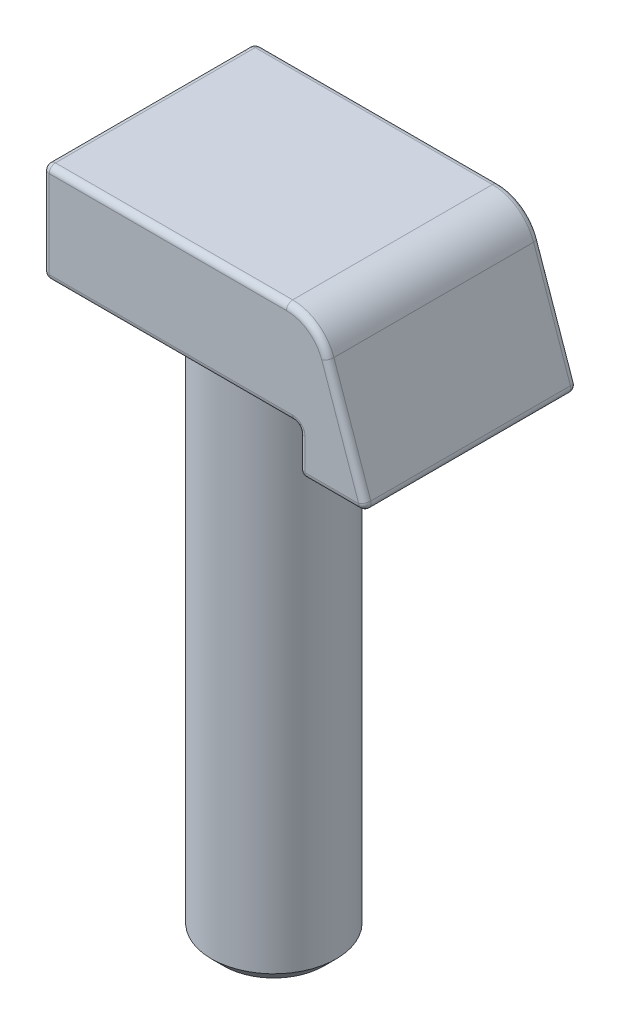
from build123d import *

# Parameters (mm, degrees)
EXTRUSION1_DEPTH = 17
CONG_1_R         = 0.5
ESQUISSE2_R      = 5
EXTRUSION2_DEPTH = 45
CHANFREIN1_SIZE  = 1


with BuildPart() as part:
    # Esquisse1 → Extrusion1 (new body)
    with BuildSketch(Plane.XY):
        with BuildLine():
            Line((0.5, 0), (20, 0))
            ThreePointArc((20, 0), (20.353553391, -0.146446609), (20.5, -0.5))
            Line((20.5, -0.5), (20.5, -3))
            ThreePointArc((20.5, -3), (20.646446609, -3.353553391), (21, -3.5))
            Line((21, -3.5), (25.296704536, -3.5))
            ThreePointArc((25.296704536, -3.5), (25.704215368, -3.289715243), (25.768952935, -2.835739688))
            Line((25.768952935, -2.835739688), (22.817453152, 5.649822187))
            ThreePointArc((22.817453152, 5.649822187), (21.539721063, 7.352575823), (19.511714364, 8))
            Line((19.511714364, 8), (0.5, 8))
            ThreePointArc((0.5, 8), (0.146446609, 7.853553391), (0, 7.5))
            Line((0, 7.5), (0, 0.5))
            ThreePointArc((0, 0.5), (0.146446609, 0.146446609), (0.5, 0))
        make_face()
    extrude(amount=EXTRUSION1_DEPTH)

    # Cong_1
    cong_1_edges = [part.edges().sort_by_distance(p)[0] for p in [
        (10.005857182, 8, 0),
        (10.005857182, 8, 17),
        (0.146446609, 7.853553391, 0),
        (0.146446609, 7.853553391, 17),
        (0, 4, 0),
        (0, 4, 17),
        (0.146446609, 0.146446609, 0),
        (0.146446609, 0.146446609, 17),
        (10.25, 0, 0),
        (10.25, 0, 17),
        (20.353553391, -0.146446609, 0),
        (20.353553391, -0.146446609, 17),
        (20.5, -1.75, 0),
        (20.5, -1.75, 17),
        (20.646446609, -3.353553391, 0),
        (20.646446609, -3.353553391, 17),
        (23.148352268, -3.5, 0),
        (23.148352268, -3.5, 17),
        (25.704215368, -3.289715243, 0),
        (25.704215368, -3.289715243, 17),
        (24.293203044, 1.40704125, 0),
        (24.293203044, 1.40704125, 17),
        (21.539721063, 7.352575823, 0),
        (21.539721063, 7.352575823, 17),
    ]]
    fillet(cong_1_edges, radius=CONG_1_R)

    # Esquisse2 → Extrusion2 (add)
    with BuildSketch(Plane.XZ):
        with Locations(Location((10, 8.5, 0), (0, 0, 90))):
            Circle(ESQUISSE2_R)
    extrude(amount=EXTRUSION2_DEPTH)

    # Chanfrein1
    chanfrein1_edges = [part.edges().sort_by_distance(p)[0] for p in [
        (10, -45, 3.5),
    ]]
    chamfer(chanfrein1_edges, length=CHANFREIN1_SIZE)


solid = part.part
